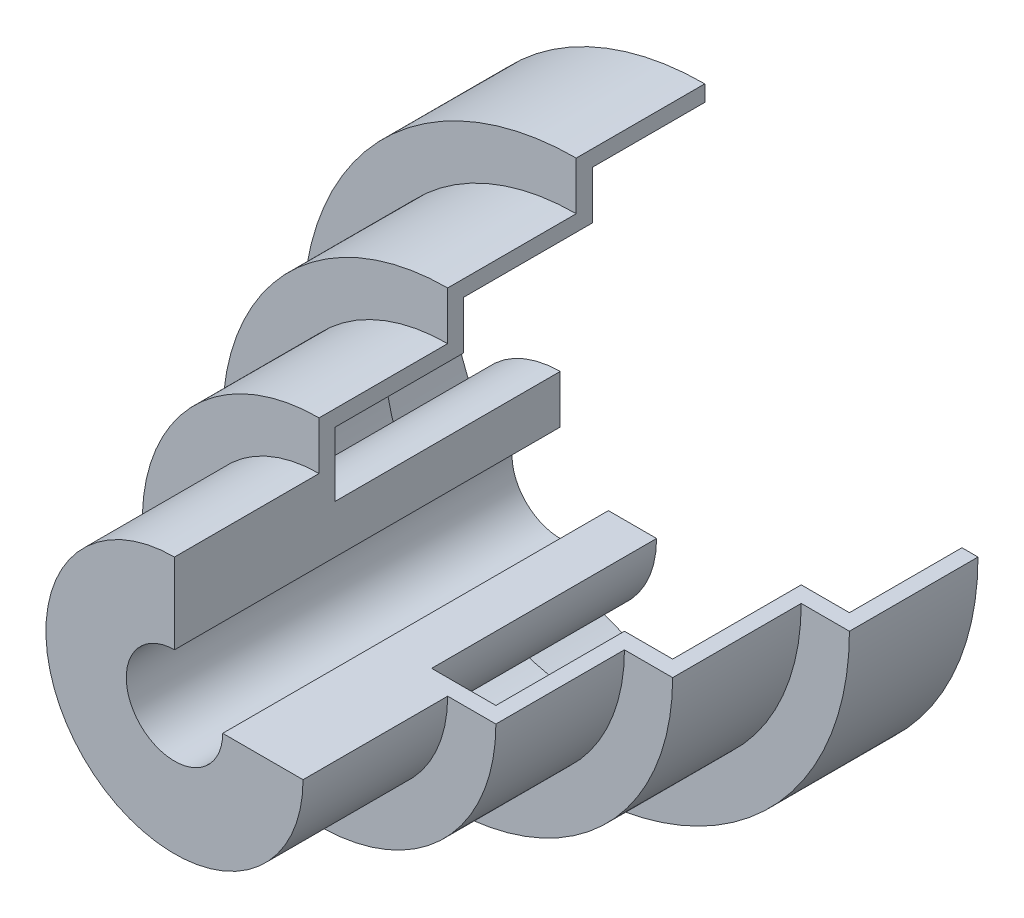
from build123d import *

# Parameters (mm, degrees)
REVOLVE1_ANGLE = 270


with BuildPart() as part:
    # Sketch1 → Revolve1 (revolve)
    with BuildSketch(Plane(origin=(0, 0, 0), x_dir=(0, 0, -1), z_dir=(1, 0, 0))):
        Polygon((-120, 15), (0, 15), (0, 30), (-70, 30), (-70, 50), (-30, 50), (-30, 65), (10, 65), (10, 80), (45, 80), (45, 85), (5, 85), (5, 70), (-35, 70), (-35, 55), (-75, 55), (-75, 40), (-120, 40), align=None)
    revolve(axis=Axis((0, 0, 0), (0, 0, 1)), revolution_arc=REVOLVE1_ANGLE)


solid = part.part
